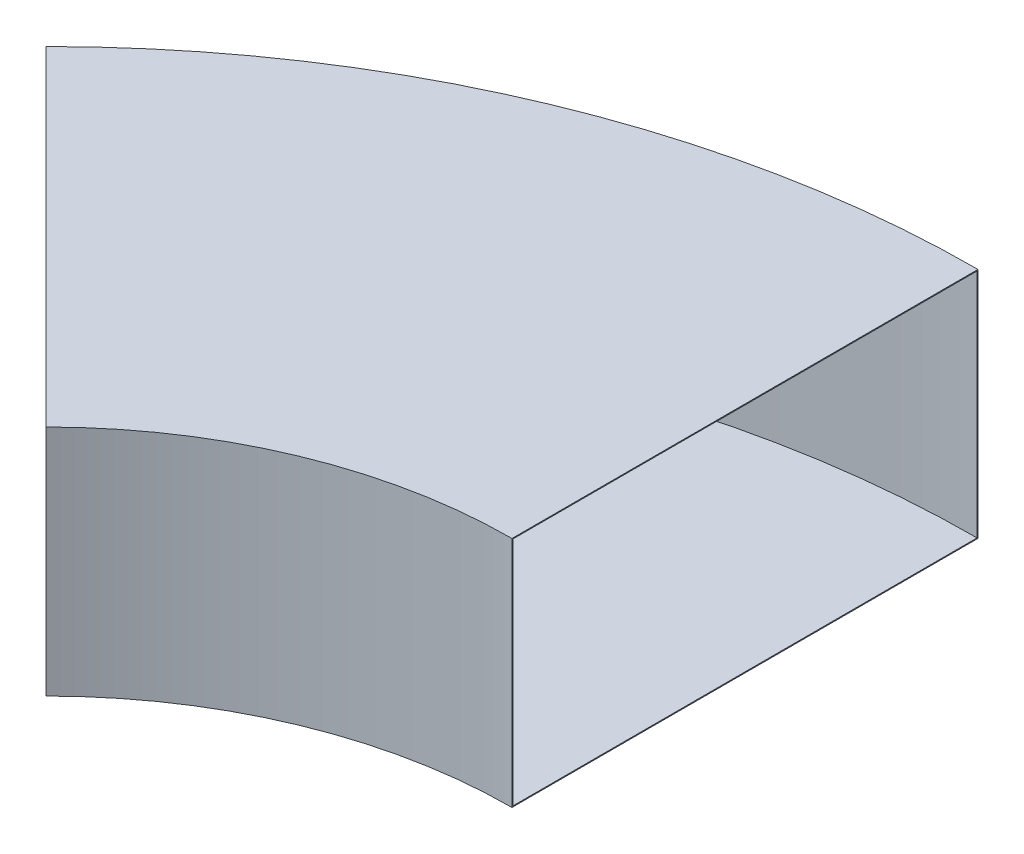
from build123d import *

# Parameters (mm, degrees)
SKETCH1_W   = 1000
SKETCH1_H   = 500
SKETCH1_W_2 = 996
SKETCH1_H_2 = 496


with BuildPart() as part:
    # Sweep-Thin1: sweep along a path in ElbowArc
    with BuildLine(Plane(origin=(0, 0, 0), x_dir=(1, 0, 0), z_dir=(0, 1, 0))) as sweep_thin1_path:
        ThreePointArc((0, 1500), (-574.025148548, 1385.819298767), (-1060.66017178, 1060.66017178))
    # Sketch1 → Sweep-Thin1 (sweep)
    with BuildSketch(Plane(origin=(0, 0, 0), x_dir=(0, 0, -1), z_dir=(1, 0, 0))):
        with Locations((1500, 0)):
            Rectangle(SKETCH1_W, SKETCH1_H)
        with Locations((1500, 0)):
            Rectangle(SKETCH1_W_2, SKETCH1_H_2, mode=Mode.SUBTRACT)
    sweep(path=sweep_thin1_path.line)


solid = part.part
